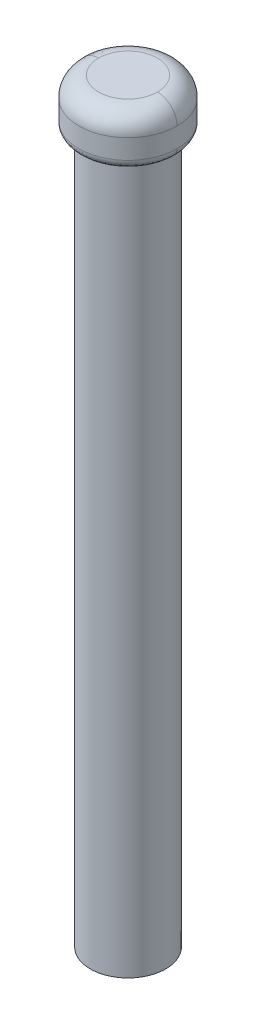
ISO-10303-21;
HEADER;
FILE_DESCRIPTION(('STEP AP214'),'2;1');
FILE_NAME('part.step','',(''),(''),'','','');
FILE_SCHEMA(('AUTOMOTIVE_DESIGN { 1 0 10303 214 1 1 1 1 }'));
ENDSEC;
DATA;
#1=APPLICATION_CONTEXT('core data for automotive mechanical design processes');
#2=APPLICATION_PROTOCOL_DEFINITION('international standard','automotive_design',2000,#1);
#3=PRODUCT_CONTEXT('',#1,'mechanical');
#4=PRODUCT('Part','Part','',(#3));
#5=PRODUCT_RELATED_PRODUCT_CATEGORY('part','',(#4));
#6=PRODUCT_DEFINITION_FORMATION('','',#4);
#7=PRODUCT_DEFINITION_CONTEXT('part definition',#1,'design');
#8=PRODUCT_DEFINITION('design','',#6,#7);
#9=PRODUCT_DEFINITION_SHAPE('','',#8);
#10=(LENGTH_UNIT() NAMED_UNIT(*) SI_UNIT(.MILLI.,.METRE.));
#11=(NAMED_UNIT(*) PLANE_ANGLE_UNIT() SI_UNIT($,.RADIAN.));
#12=(NAMED_UNIT(*) SI_UNIT($,.STERADIAN.) SOLID_ANGLE_UNIT());
#13=UNCERTAINTY_MEASURE_WITH_UNIT(LENGTH_MEASURE(1.E-05),#10,'distance_accuracy_value','');
#14=(GEOMETRIC_REPRESENTATION_CONTEXT(3) GLOBAL_UNCERTAINTY_ASSIGNED_CONTEXT((#13)) GLOBAL_UNIT_ASSIGNED_CONTEXT((#10,
#11,#12)) REPRESENTATION_CONTEXT('',''));
#15=CARTESIAN_POINT('',(0.,0.,0.));
#16=DIRECTION('',(0.,0.,1.));
#17=DIRECTION('',(1.,0.,0.));
#18=AXIS2_PLACEMENT_3D('',#15,#16,#17);
#19=CARTESIAN_POINT('',(0.5565064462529,2.75,75.50901036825));
#20=DIRECTION('',(0.,-1.,0.));
#21=DIRECTION('',(-1.,0.,0.));
#22=AXIS2_PLACEMENT_3D('',#19,#20,#21);
#23=PLANE('',#22);
#24=CARTESIAN_POINT('',(0.2445064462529,2.74999999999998,75.197010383));
#25=DIRECTION('',(0.,-1.,0.));
#26=DIRECTION('',(1.,0.,0.));
#27=AXIS2_PLACEMENT_3D('',#24,#25,#26);
#28=CIRCLE('',#27,0.299999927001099);
#29=CARTESIAN_POINT('',(-0.0554934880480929,2.74999999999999,75.1970103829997));
#30=VERTEX_POINT('',#29);
#31=CARTESIAN_POINT('',(0.544506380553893,2.74999999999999,75.1970103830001));
#32=VERTEX_POINT('',#31);
#33=EDGE_CURVE('E58',#30,#32,#28,.F.);
#34=ORIENTED_EDGE('',*,*,#33,.T.);
#35=CARTESIAN_POINT('',(0.2445064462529,2.74999999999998,75.197010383));
#36=DIRECTION('',(0.,-1.,0.));
#37=DIRECTION('',(-1.,0.,-1.7115942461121E-12));
#38=AXIS2_PLACEMENT_3D('',#35,#36,#37);
#39=CIRCLE('',#38,0.299999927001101);
#40=EDGE_CURVE('E54',#32,#30,#39,.F.);
#41=ORIENTED_EDGE('',*,*,#40,.T.);
#42=EDGE_LOOP('',(#34,#41));
#43=FACE_BOUND('',#42,.T.);
#44=ADVANCED_FACE('F16',(#43),#23,.F.);
#45=CARTESIAN_POINT('',(0.534129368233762,2.74974085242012,75.2077504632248));
#46=CARTESIAN_POINT('',(0.660722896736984,2.75619599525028,75.2124449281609));
#47=CARTESIAN_POINT('',(0.75035433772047,2.66650326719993,75.2157687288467));
#48=CARTESIAN_POINT('',(0.743904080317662,2.53982270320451,75.2155295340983));
#49=(BOUNDED_CURVE() B_SPLINE_CURVE(3,(#45,#46,#47,#48),.UNSPECIFIED.,.F.,
.F.) B_SPLINE_CURVE_WITH_KNOTS((4,4),(0.,1.),
.UNSPECIFIED.) CURVE() GEOMETRIC_REPRESENTATION_ITEM() RATIONAL_B_SPLINE_CURVE((1.,
0.780138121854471,0.780138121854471,1.)) REPRESENTATION_ITEM(''));
#50=CARTESIAN_POINT('',(0.2445064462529,2.55,75.197010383));
#51=DIRECTION('',(0.,-1.,0.));
#52=AXIS1_PLACEMENT('',#50,#51);
#53=SURFACE_OF_REVOLUTION('',#49,#52);
#54=CARTESIAN_POINT('',(0.2445064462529,2.55,75.197010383));
#55=DIRECTION('',(0.,-1.,0.));
#56=DIRECTION('',(-1.,0.,0.));
#57=AXIS2_PLACEMENT_3D('',#54,#55,#56);
#58=CIRCLE('',#57,0.5);
#59=CARTESIAN_POINT('',(0.744506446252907,2.55,75.1970103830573));
#60=VERTEX_POINT('',#59);
#61=CARTESIAN_POINT('',(-0.255493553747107,2.55,75.197010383));
#62=VERTEX_POINT('',#61);
#63=EDGE_CURVE('E78',#60,#62,#58,.F.);
#64=ORIENTED_EDGE('',*,*,#63,.T.);
#65=CARTESIAN_POINT('',(-0.0554935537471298,2.55,75.1970103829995));
#66=DIRECTION('',(-2.52060023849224E-12,0.,-1.));
#67=DIRECTION('',(-1.,0.,2.52060023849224E-12));
#68=AXIS2_PLACEMENT_3D('',#65,#66,#67);
#69=CIRCLE('',#68,0.199999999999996);
#70=EDGE_CURVE('E71',#62,#30,#69,.T.);
#71=ORIENTED_EDGE('',*,*,#70,.T.);
#72=ORIENTED_EDGE('',*,*,#40,.F.);
#73=CARTESIAN_POINT('',(0.54450644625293,2.55,75.197010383));
#74=DIRECTION('',(-4.277954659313E-12,1.08423003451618E-13,-1.));
#75=DIRECTION('',(-1.,0.,4.277954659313E-12));
#76=AXIS2_PLACEMENT_3D('',#73,#74,#75);
#77=CIRCLE('',#76,0.199999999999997);
#78=EDGE_CURVE('E64',#32,#60,#77,.T.);
#79=ORIENTED_EDGE('',*,*,#78,.T.);
#80=EDGE_LOOP('',(#64,#71,#72,#79));
#81=FACE_BOUND('',#80,.T.);
#82=ADVANCED_FACE('F69',(#81),#53,.T.);
#83=CARTESIAN_POINT('',(-0.0451164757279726,2.74974085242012,75.1862703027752));
#84=CARTESIAN_POINT('',(-0.171710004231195,2.75619599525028,75.1815758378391));
#85=CARTESIAN_POINT('',(-0.26134144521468,2.66650326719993,75.1782520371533));
#86=CARTESIAN_POINT('',(-0.254891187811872,2.53982270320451,75.1784912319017));
#87=(BOUNDED_CURVE() B_SPLINE_CURVE(3,(#83,#84,#85,#86),.UNSPECIFIED.,.F.,
.F.) B_SPLINE_CURVE_WITH_KNOTS((4,4),(0.,1.),
.UNSPECIFIED.) CURVE() GEOMETRIC_REPRESENTATION_ITEM() RATIONAL_B_SPLINE_CURVE((1.,
0.780138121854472,0.780138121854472,1.)) REPRESENTATION_ITEM(''));
#88=CARTESIAN_POINT('',(0.2445064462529,2.55,75.197010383));
#89=DIRECTION('',(0.,-1.,0.));
#90=AXIS1_PLACEMENT('',#88,#89);
#91=SURFACE_OF_REVOLUTION('',#87,#90);
#92=CARTESIAN_POINT('',(0.2445064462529,2.55,75.197010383));
#93=DIRECTION('',(0.,-1.,0.));
#94=DIRECTION('',(-1.,0.,0.));
#95=AXIS2_PLACEMENT_3D('',#92,#93,#94);
#96=CIRCLE('',#95,0.5);
#97=EDGE_CURVE('E75',#62,#60,#96,.F.);
#98=ORIENTED_EDGE('',*,*,#97,.T.);
#99=ORIENTED_EDGE('',*,*,#78,.F.);
#100=ORIENTED_EDGE('',*,*,#33,.F.);
#101=ORIENTED_EDGE('',*,*,#70,.F.);
#102=EDGE_LOOP('',(#98,#99,#100,#101));
#103=FACE_BOUND('',#102,.T.);
#104=ADVANCED_FACE('F73',(#103),#91,.T.);
#105=CARTESIAN_POINT('',(0.2445064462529,2.55,75.197010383));
#106=DIRECTION('',(0.,-1.,0.));
#107=DIRECTION('',(0.,0.,-1.));
#108=AXIS2_PLACEMENT_3D('',#105,#106,#107);
#109=CYLINDRICAL_SURFACE('',#108,0.5);
#110=CARTESIAN_POINT('',(0.2445064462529,2.35,75.197010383));
#111=DIRECTION('',(0.,-1.,0.));
#112=DIRECTION('',(-0.999685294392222,0.,-0.0250860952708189));
#113=AXIS2_PLACEMENT_3D('',#110,#111,#112);
#114=CIRCLE('',#113,0.500000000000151);
#115=CARTESIAN_POINT('',(-0.255493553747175,2.35,75.1970103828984));
#116=VERTEX_POINT('',#115);
#117=CARTESIAN_POINT('',(0.744506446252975,2.35,75.1970103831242));
#118=VERTEX_POINT('',#117);
#119=EDGE_CURVE('E152',#116,#118,#114,.F.);
#120=ORIENTED_EDGE('',*,*,#119,.T.);
#121=CARTESIAN_POINT('',(0.2445064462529,2.35,75.197010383));
#122=DIRECTION('',(0.,-1.,0.));
#123=DIRECTION('',(0.999685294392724,0.,0.025086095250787));
#124=AXIS2_PLACEMENT_3D('',#121,#122,#123);
#125=CIRCLE('',#124,0.5);
#126=EDGE_CURVE('E179',#118,#116,#125,.F.);
#127=ORIENTED_EDGE('',*,*,#126,.T.);
#128=EDGE_LOOP('',(#120,#127));
#129=FACE_BOUND('',#128,.T.);
#130=ORIENTED_EDGE('',*,*,#63,.F.);
#131=ORIENTED_EDGE('',*,*,#97,.F.);
#132=EDGE_LOOP('',(#130,#131));
#133=FACE_BOUND('',#132,.T.);
#134=ADVANCED_FACE('F172',(#129,#133),#109,.T.);
#135=CARTESIAN_POINT('',(0.74383136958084,2.36016411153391,75.2095404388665));
#136=CARTESIAN_POINT('',(0.750793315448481,2.2920020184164,75.2097151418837));
#137=CARTESIAN_POINT('',(0.702359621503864,2.24355338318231,75.2084997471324));
#138=CARTESIAN_POINT('',(0.634219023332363,2.25051795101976,75.2067898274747));
#139=(BOUNDED_CURVE() B_SPLINE_CURVE(3,(#135,#136,#137,#138),.UNSPECIFIED.,.F.,
.F.) B_SPLINE_CURVE_WITH_KNOTS((4,4),(0.,1.),
.UNSPECIFIED.) CURVE() GEOMETRIC_REPRESENTATION_ITEM() RATIONAL_B_SPLINE_CURVE((1.,
0.754380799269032,0.754380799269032,1.)) REPRESENTATION_ITEM(''));
#140=CARTESIAN_POINT('',(0.2445064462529,2.35,75.197010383));
#141=DIRECTION('',(0.,-1.,0.));
#142=AXIS1_PLACEMENT('',#140,#141);
#143=SURFACE_OF_REVOLUTION('',#139,#142);
#144=CARTESIAN_POINT('',(0.2445064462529,2.25,75.197010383));
#145=DIRECTION('',(0.,1.,0.));
#146=DIRECTION('',(1.,0.,2.50043058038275E-10));
#147=AXIS2_PLACEMENT_3D('',#144,#145,#146);
#148=CIRCLE('',#147,0.399999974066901);
#149=CARTESIAN_POINT('',(0.6445064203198,2.25,75.1970103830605));
#150=VERTEX_POINT('',#149);
#151=CARTESIAN_POINT('',(-0.15549351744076,2.25,75.1970103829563));
#152=VERTEX_POINT('',#151);
#153=EDGE_CURVE('E33',#150,#152,#148,.T.);
#154=ORIENTED_EDGE('',*,*,#153,.T.);
#155=CARTESIAN_POINT('',(-0.155493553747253,2.35,75.19701038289));
#156=DIRECTION('',(2.54082369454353E-10,1.0111598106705E-13,-1.));
#157=DIRECTION('',(-1.,0.,-2.54082369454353E-10));
#158=AXIS2_PLACEMENT_3D('',#155,#156,#157);
#159=CIRCLE('',#158,0.099999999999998);
#160=EDGE_CURVE('E147',#152,#116,#159,.T.);
#161=ORIENTED_EDGE('',*,*,#160,.T.);
#162=ORIENTED_EDGE('',*,*,#126,.F.);
#163=CARTESIAN_POINT('',(0.644506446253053,2.35,75.1970103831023));
#164=DIRECTION('',(2.34973324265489E-10,1.86105939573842E-13,-1.));
#165=DIRECTION('',(-1.,0.,-2.34973324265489E-10));
#166=AXIS2_PLACEMENT_3D('',#163,#164,#165);
#167=CIRCLE('',#166,0.099999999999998);
#168=EDGE_CURVE('E148',#118,#150,#167,.T.);
#169=ORIENTED_EDGE('',*,*,#168,.T.);
#170=EDGE_LOOP('',(#154,#161,#162,#169));
#171=FACE_BOUND('',#170,.T.);
#172=ADVANCED_FACE('F167',(#171),#143,.T.);
#173=CARTESIAN_POINT('',(-0.25481847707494,2.36016411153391,75.1844803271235));
#174=CARTESIAN_POINT('',(-0.261780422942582,2.2920020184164,75.1843056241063));
#175=CARTESIAN_POINT('',(-0.213346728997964,2.24355338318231,75.1855210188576));
#176=CARTESIAN_POINT('',(-0.145206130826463,2.25051795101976,75.1872309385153));
#177=(BOUNDED_CURVE() B_SPLINE_CURVE(3,(#173,#174,#175,#176),.UNSPECIFIED.,.F.,
.F.) B_SPLINE_CURVE_WITH_KNOTS((4,4),(0.,1.),
.UNSPECIFIED.) CURVE() GEOMETRIC_REPRESENTATION_ITEM() RATIONAL_B_SPLINE_CURVE((1.,
0.754380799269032,0.754380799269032,1.)) REPRESENTATION_ITEM(''));
#178=CARTESIAN_POINT('',(0.2445064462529,2.35,75.197010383));
#179=DIRECTION('',(0.,-1.,0.));
#180=AXIS1_PLACEMENT('',#178,#179);
#181=SURFACE_OF_REVOLUTION('',#177,#180);
#182=CARTESIAN_POINT('',(0.2445064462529,2.25,75.197010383));
#183=DIRECTION('',(0.,1.,0.));
#184=DIRECTION('',(-1.,0.,0.));
#185=AXIS2_PLACEMENT_3D('',#182,#183,#184);
#186=CIRCLE('',#185,0.4);
#187=EDGE_CURVE('E135',#152,#150,#186,.T.);
#188=ORIENTED_EDGE('',*,*,#187,.T.);
#189=ORIENTED_EDGE('',*,*,#168,.F.);
#190=ORIENTED_EDGE('',*,*,#119,.F.);
#191=ORIENTED_EDGE('',*,*,#160,.F.);
#192=EDGE_LOOP('',(#188,#189,#190,#191));
#193=FACE_BOUND('',#192,.T.);
#194=ADVANCED_FACE('F171',(#193),#181,.T.);
#195=CARTESIAN_POINT('',(0.6605064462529,2.25,75.61301038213));
#196=DIRECTION('',(0.,-1.,0.));
#197=DIRECTION('',(-1.,0.,0.));
#198=AXIS2_PLACEMENT_3D('',#195,#196,#197);
#199=PLANE('',#198);
#200=CARTESIAN_POINT('',(0.2445064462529,2.25,75.197010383));
#201=DIRECTION('',(0.,-1.,0.));
#202=DIRECTION('',(0.,0.,-1.));
#203=AXIS2_PLACEMENT_3D('',#200,#201,#202);
#204=CIRCLE('',#203,0.385);
#205=CARTESIAN_POINT('',(0.2445064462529,2.25,74.812010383));
#206=VERTEX_POINT('',#205);
#207=EDGE_CURVE('E20',#206,#206,#204,.F.);
#208=ORIENTED_EDGE('',*,*,#207,.T.);
#209=EDGE_LOOP('',(#208));
#210=FACE_BOUND('',#209,.T.);
#211=ORIENTED_EDGE('',*,*,#153,.F.);
#212=ORIENTED_EDGE('',*,*,#187,.F.);
#213=EDGE_LOOP('',(#211,#212));
#214=FACE_BOUND('',#213,.T.);
#215=ADVANCED_FACE('F108',(#210,#214),#199,.T.);
#216=CARTESIAN_POINT('',(0.2445064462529,2.25,75.197010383));
#217=DIRECTION('',(0.,-1.,0.));
#218=DIRECTION('',(0.,0.,-1.));
#219=AXIS2_PLACEMENT_3D('',#216,#217,#218);
#220=CYLINDRICAL_SURFACE('',#219,0.385);
#221=ORIENTED_EDGE('',*,*,#207,.F.);
#222=EDGE_LOOP('',(#221));
#223=FACE_BOUND('',#222,.T.);
#224=CARTESIAN_POINT('',(0.2445064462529,-4.95,75.197010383));
#225=DIRECTION('',(0.,-1.,0.));
#226=DIRECTION('',(0.,0.,-1.));
#227=AXIS2_PLACEMENT_3D('',#224,#225,#226);
#228=CIRCLE('',#227,0.385);
#229=CARTESIAN_POINT('',(0.2445064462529,-4.95,74.812010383));
#230=VERTEX_POINT('',#229);
#231=EDGE_CURVE('E11',#230,#230,#228,.F.);
#232=ORIENTED_EDGE('',*,*,#231,.T.);
#233=EDGE_LOOP('',(#232));
#234=FACE_BOUND('',#233,.T.);
#235=ADVANCED_FACE('F210',(#223,#234),#220,.T.);
#236=CARTESIAN_POINT('',(0.6449064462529,-4.95,75.59824478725));
#237=DIRECTION('',(0.,-1.,0.));
#238=DIRECTION('',(-1.,0.,0.));
#239=AXIS2_PLACEMENT_3D('',#236,#237,#238);
#240=PLANE('',#239);
#241=ORIENTED_EDGE('',*,*,#231,.F.);
#242=EDGE_LOOP('',(#241));
#243=FACE_BOUND('',#242,.T.);
#244=ADVANCED_FACE('F18',(#243),#240,.T.);
#245=CLOSED_SHELL('',(#44,#82,#104,#134,#172,#194,#215,#235,#244));
#246=MANIFOLD_SOLID_BREP('B1',#245);
#247=ADVANCED_BREP_SHAPE_REPRESENTATION('',(#18,#246),#14);
#248=SHAPE_DEFINITION_REPRESENTATION(#9,#247);
ENDSEC;
END-ISO-10303-21;
